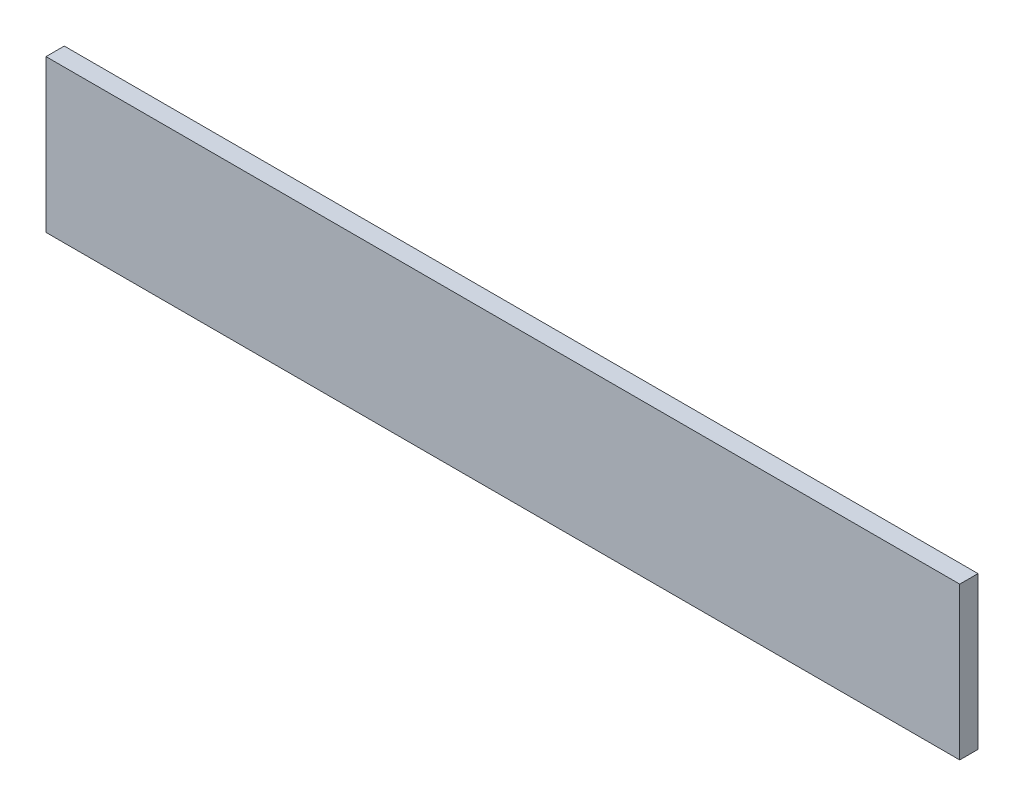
from build123d import *

# Parameters (mm, degrees)
SKETCH1_W      = 300
SKETCH1_H      = 50
EXTRUDE1_DEPTH = 6


with BuildPart() as part:
    # Sketch1 → Extrude1 (new body)
    with BuildSketch(Plane.XY):
        with Locations((0, 25)):
            Rectangle(SKETCH1_W, SKETCH1_H)
    extrude(amount=EXTRUDE1_DEPTH)


solid = part.part
